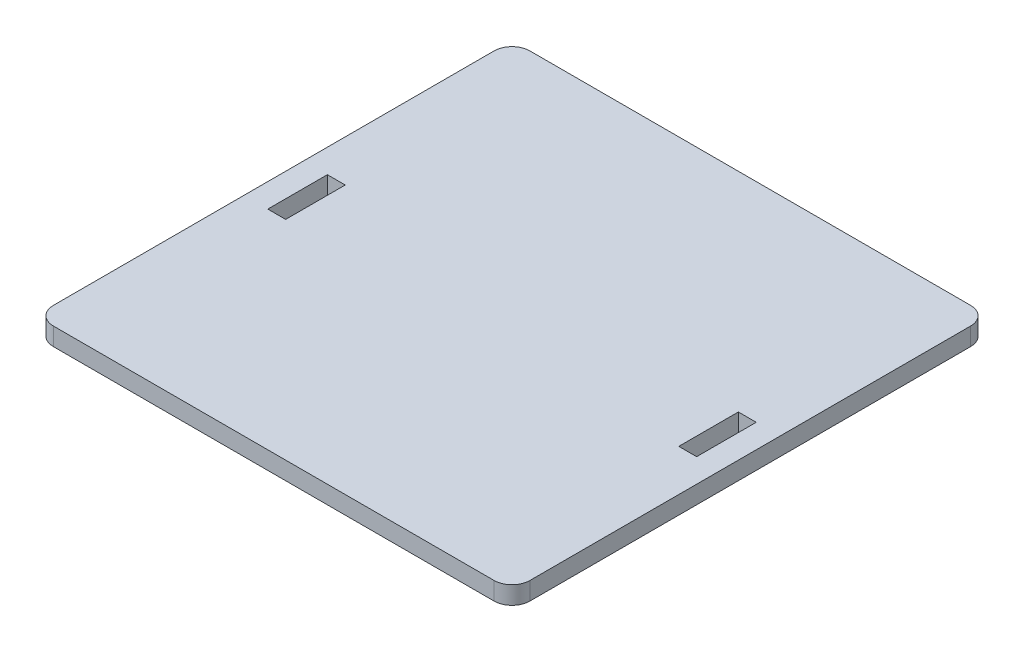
ISO-10303-21;
HEADER;
FILE_DESCRIPTION(('STEP AP214'),'2;1');
FILE_NAME('part.step','',(''),(''),'','','');
FILE_SCHEMA(('AUTOMOTIVE_DESIGN { 1 0 10303 214 1 1 1 1 }'));
ENDSEC;
DATA;
#1=APPLICATION_CONTEXT('core data for automotive mechanical design processes');
#2=APPLICATION_PROTOCOL_DEFINITION('international standard','automotive_design',2000,#1);
#3=PRODUCT_CONTEXT('',#1,'mechanical');
#4=PRODUCT('Part','Part','',(#3));
#5=PRODUCT_RELATED_PRODUCT_CATEGORY('part','',(#4));
#6=PRODUCT_DEFINITION_FORMATION('','',#4);
#7=PRODUCT_DEFINITION_CONTEXT('part definition',#1,'design');
#8=PRODUCT_DEFINITION('design','',#6,#7);
#9=PRODUCT_DEFINITION_SHAPE('','',#8);
#10=(LENGTH_UNIT() NAMED_UNIT(*) SI_UNIT(.MILLI.,.METRE.));
#11=(NAMED_UNIT(*) PLANE_ANGLE_UNIT() SI_UNIT($,.RADIAN.));
#12=(NAMED_UNIT(*) SI_UNIT($,.STERADIAN.) SOLID_ANGLE_UNIT());
#13=UNCERTAINTY_MEASURE_WITH_UNIT(LENGTH_MEASURE(1.E-05),#10,'distance_accuracy_value','');
#14=(GEOMETRIC_REPRESENTATION_CONTEXT(3) GLOBAL_UNCERTAINTY_ASSIGNED_CONTEXT((#13)) GLOBAL_UNIT_ASSIGNED_CONTEXT((#10,
#11,#12)) REPRESENTATION_CONTEXT('',''));
#15=CARTESIAN_POINT('',(0.,0.,0.));
#16=DIRECTION('',(0.,0.,1.));
#17=DIRECTION('',(1.,0.,0.));
#18=AXIS2_PLACEMENT_3D('',#15,#16,#17);
#19=CARTESIAN_POINT('',(74.,6.,-154.));
#20=DIRECTION('',(0.,-1.,0.));
#21=DIRECTION('',(0.,0.,-1.));
#22=AXIS2_PLACEMENT_3D('',#19,#20,#21);
#23=PLANE('',#22);
#24=DIRECTION('',(0.,0.,1.));
#25=VECTOR('',#24,1.);
#26=CARTESIAN_POINT('',(-72.,6.,-90.));
#27=LINE('',#26,#25);
#28=CARTESIAN_POINT('',(-72.,6.,-90.));
#29=VERTEX_POINT('',#28);
#30=CARTESIAN_POINT('',(-72.,6.,-70.));
#31=VERTEX_POINT('',#30);
#32=EDGE_CURVE('E188',#29,#31,#27,.T.);
#33=ORIENTED_EDGE('',*,*,#32,.F.);
#34=DIRECTION('',(-1.,0.,0.));
#35=VECTOR('',#34,1.);
#36=CARTESIAN_POINT('',(-72.,6.,-90.));
#37=LINE('',#36,#35);
#38=CARTESIAN_POINT('',(-66.,6.,-90.));
#39=VERTEX_POINT('',#38);
#40=EDGE_CURVE('E196',#39,#29,#37,.T.);
#41=ORIENTED_EDGE('',*,*,#40,.F.);
#42=DIRECTION('',(0.,0.,-1.));
#43=VECTOR('',#42,1.);
#44=CARTESIAN_POINT('',(-66.,6.,-90.));
#45=LINE('',#44,#43);
#46=CARTESIAN_POINT('',(-66.,6.,-70.));
#47=VERTEX_POINT('',#46);
#48=EDGE_CURVE('E193',#47,#39,#45,.T.);
#49=ORIENTED_EDGE('',*,*,#48,.F.);
#50=DIRECTION('',(1.,0.,0.));
#51=VECTOR('',#50,1.);
#52=CARTESIAN_POINT('',(-72.,6.,-70.));
#53=LINE('',#52,#51);
#54=EDGE_CURVE('E190',#31,#47,#53,.T.);
#55=ORIENTED_EDGE('',*,*,#54,.F.);
#56=EDGE_LOOP('',(#33,#41,#49,#55));
#57=FACE_BOUND('',#56,.T.);
#58=CARTESIAN_POINT('',(74.,6.,-154.));
#59=DIRECTION('',(0.,1.,0.));
#60=DIRECTION('',(0.,0.,-1.));
#61=AXIS2_PLACEMENT_3D('',#58,#59,#60);
#62=CIRCLE('',#61,5.99999999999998);
#63=CARTESIAN_POINT('',(80.,6.,-154.));
#64=VERTEX_POINT('',#63);
#65=CARTESIAN_POINT('',(74.,6.,-160.));
#66=VERTEX_POINT('',#65);
#67=EDGE_CURVE('E219',#64,#66,#62,.T.);
#68=ORIENTED_EDGE('',*,*,#67,.T.);
#69=DIRECTION('',(-1.,0.,0.));
#70=VECTOR('',#69,1.);
#71=CARTESIAN_POINT('',(-74.,6.,-160.));
#72=LINE('',#71,#70);
#73=CARTESIAN_POINT('',(-74.,6.,-160.));
#74=VERTEX_POINT('',#73);
#75=EDGE_CURVE('E222',#66,#74,#72,.T.);
#76=ORIENTED_EDGE('',*,*,#75,.T.);
#77=CARTESIAN_POINT('',(-74.,6.,-154.));
#78=DIRECTION('',(0.,1.,0.));
#79=DIRECTION('',(0.,0.,-1.));
#80=AXIS2_PLACEMENT_3D('',#77,#78,#79);
#81=CIRCLE('',#80,5.99999999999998);
#82=CARTESIAN_POINT('',(-80.,6.,-154.));
#83=VERTEX_POINT('',#82);
#84=EDGE_CURVE('E225',#74,#83,#81,.T.);
#85=ORIENTED_EDGE('',*,*,#84,.T.);
#86=DIRECTION('',(0.,0.,1.));
#87=VECTOR('',#86,1.);
#88=CARTESIAN_POINT('',(-80.,6.,-6.00000000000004));
#89=LINE('',#88,#87);
#90=CARTESIAN_POINT('',(-80.,6.,-6.00000000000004));
#91=VERTEX_POINT('',#90);
#92=EDGE_CURVE('E227',#83,#91,#89,.T.);
#93=ORIENTED_EDGE('',*,*,#92,.T.);
#94=CARTESIAN_POINT('',(-74.,6.,-6.));
#95=DIRECTION('',(0.,1.,0.));
#96=DIRECTION('',(0.,0.,-1.));
#97=AXIS2_PLACEMENT_3D('',#94,#95,#96);
#98=CIRCLE('',#97,6.);
#99=CARTESIAN_POINT('',(-74.,6.,0.));
#100=VERTEX_POINT('',#99);
#101=EDGE_CURVE('E229',#91,#100,#98,.T.);
#102=ORIENTED_EDGE('',*,*,#101,.T.);
#103=DIRECTION('',(1.,0.,0.));
#104=VECTOR('',#103,1.);
#105=CARTESIAN_POINT('',(-74.,6.,0.));
#106=LINE('',#105,#104);
#107=CARTESIAN_POINT('',(74.,6.,0.));
#108=VERTEX_POINT('',#107);
#109=EDGE_CURVE('E231',#100,#108,#106,.T.);
#110=ORIENTED_EDGE('',*,*,#109,.T.);
#111=CARTESIAN_POINT('',(74.,6.,-6.00000000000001));
#112=DIRECTION('',(0.,1.,0.));
#113=DIRECTION('',(0.,0.,1.));
#114=AXIS2_PLACEMENT_3D('',#111,#112,#113);
#115=CIRCLE('',#114,6.);
#116=CARTESIAN_POINT('',(80.,6.,-6.00000000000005));
#117=VERTEX_POINT('',#116);
#118=EDGE_CURVE('E233',#108,#117,#115,.T.);
#119=ORIENTED_EDGE('',*,*,#118,.T.);
#120=DIRECTION('',(0.,0.,-1.));
#121=VECTOR('',#120,1.);
#122=CARTESIAN_POINT('',(80.,6.,-6.00000000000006));
#123=LINE('',#122,#121);
#124=EDGE_CURVE('E235',#117,#64,#123,.T.);
#125=ORIENTED_EDGE('',*,*,#124,.T.);
#126=EDGE_LOOP('',(#68,#76,#85,#93,#102,#110,#119,#125));
#127=FACE_BOUND('',#126,.T.);
#128=DIRECTION('',(0.,0.,-1.));
#129=VECTOR('',#128,1.);
#130=CARTESIAN_POINT('',(72.,6.,-90.));
#131=LINE('',#130,#129);
#132=CARTESIAN_POINT('',(72.,6.,-70.));
#133=VERTEX_POINT('',#132);
#134=CARTESIAN_POINT('',(72.,6.,-90.));
#135=VERTEX_POINT('',#134);
#136=EDGE_CURVE('E152',#133,#135,#131,.T.);
#137=ORIENTED_EDGE('',*,*,#136,.F.);
#138=DIRECTION('',(1.,0.,0.));
#139=VECTOR('',#138,1.);
#140=CARTESIAN_POINT('',(72.,6.,-70.));
#141=LINE('',#140,#139);
#142=CARTESIAN_POINT('',(66.,6.,-70.));
#143=VERTEX_POINT('',#142);
#144=EDGE_CURVE('E174',#143,#133,#141,.T.);
#145=ORIENTED_EDGE('',*,*,#144,.F.);
#146=DIRECTION('',(0.,0.,1.));
#147=VECTOR('',#146,1.);
#148=CARTESIAN_POINT('',(66.,6.,-90.));
#149=LINE('',#148,#147);
#150=CARTESIAN_POINT('',(66.,6.,-90.));
#151=VERTEX_POINT('',#150);
#152=EDGE_CURVE('E172',#151,#143,#149,.T.);
#153=ORIENTED_EDGE('',*,*,#152,.F.);
#154=DIRECTION('',(-1.,0.,0.));
#155=VECTOR('',#154,1.);
#156=CARTESIAN_POINT('',(72.,6.,-90.));
#157=LINE('',#156,#155);
#158=EDGE_CURVE('E160',#135,#151,#157,.T.);
#159=ORIENTED_EDGE('',*,*,#158,.F.);
#160=EDGE_LOOP('',(#137,#145,#153,#159));
#161=FACE_BOUND('',#160,.T.);
#162=ADVANCED_FACE('F39',(#57,#127,#161),#23,.F.);
#163=CARTESIAN_POINT('',(74.,0.,-154.));
#164=DIRECTION('',(0.,-1.,0.));
#165=DIRECTION('',(0.,0.,-1.));
#166=AXIS2_PLACEMENT_3D('',#163,#164,#165);
#167=PLANE('',#166);
#168=CARTESIAN_POINT('',(74.,0.,-154.));
#169=DIRECTION('',(0.,1.,0.));
#170=DIRECTION('',(0.,0.,-1.));
#171=AXIS2_PLACEMENT_3D('',#168,#169,#170);
#172=CIRCLE('',#171,5.99999999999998);
#173=CARTESIAN_POINT('',(80.,0.,-154.));
#174=VERTEX_POINT('',#173);
#175=CARTESIAN_POINT('',(74.,0.,-160.));
#176=VERTEX_POINT('',#175);
#177=EDGE_CURVE('E218',#174,#176,#172,.T.);
#178=ORIENTED_EDGE('',*,*,#177,.F.);
#179=DIRECTION('',(0.,0.,-1.));
#180=VECTOR('',#179,1.);
#181=CARTESIAN_POINT('',(80.,0.,-6.00000000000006));
#182=LINE('',#181,#180);
#183=CARTESIAN_POINT('',(80.,0.,-6.00000000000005));
#184=VERTEX_POINT('',#183);
#185=EDGE_CURVE('E223',#184,#174,#182,.T.);
#186=ORIENTED_EDGE('',*,*,#185,.F.);
#187=CARTESIAN_POINT('',(74.,0.,-6.00000000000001));
#188=DIRECTION('',(0.,1.,0.));
#189=DIRECTION('',(0.,0.,1.));
#190=AXIS2_PLACEMENT_3D('',#187,#188,#189);
#191=CIRCLE('',#190,6.);
#192=CARTESIAN_POINT('',(74.,0.,0.));
#193=VERTEX_POINT('',#192);
#194=EDGE_CURVE('E250',#193,#184,#191,.T.);
#195=ORIENTED_EDGE('',*,*,#194,.F.);
#196=DIRECTION('',(1.,0.,0.));
#197=VECTOR('',#196,1.);
#198=CARTESIAN_POINT('',(-74.,0.,0.));
#199=LINE('',#198,#197);
#200=CARTESIAN_POINT('',(-74.,0.,0.));
#201=VERTEX_POINT('',#200);
#202=EDGE_CURVE('E248',#201,#193,#199,.T.);
#203=ORIENTED_EDGE('',*,*,#202,.F.);
#204=CARTESIAN_POINT('',(-74.,0.,-6.));
#205=DIRECTION('',(0.,1.,0.));
#206=DIRECTION('',(0.,0.,-1.));
#207=AXIS2_PLACEMENT_3D('',#204,#205,#206);
#208=CIRCLE('',#207,6.);
#209=CARTESIAN_POINT('',(-80.,0.,-6.00000000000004));
#210=VERTEX_POINT('',#209);
#211=EDGE_CURVE('E246',#210,#201,#208,.T.);
#212=ORIENTED_EDGE('',*,*,#211,.F.);
#213=DIRECTION('',(0.,0.,1.));
#214=VECTOR('',#213,1.);
#215=CARTESIAN_POINT('',(-80.,0.,-6.00000000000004));
#216=LINE('',#215,#214);
#217=CARTESIAN_POINT('',(-80.,0.,-154.));
#218=VERTEX_POINT('',#217);
#219=EDGE_CURVE('E244',#218,#210,#216,.T.);
#220=ORIENTED_EDGE('',*,*,#219,.F.);
#221=CARTESIAN_POINT('',(-74.,0.,-154.));
#222=DIRECTION('',(0.,1.,0.));
#223=DIRECTION('',(0.,0.,-1.));
#224=AXIS2_PLACEMENT_3D('',#221,#222,#223);
#225=CIRCLE('',#224,5.99999999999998);
#226=CARTESIAN_POINT('',(-74.,0.,-160.));
#227=VERTEX_POINT('',#226);
#228=EDGE_CURVE('E242',#227,#218,#225,.T.);
#229=ORIENTED_EDGE('',*,*,#228,.F.);
#230=DIRECTION('',(-1.,0.,0.));
#231=VECTOR('',#230,1.);
#232=CARTESIAN_POINT('',(-74.,0.,-160.));
#233=LINE('',#232,#231);
#234=EDGE_CURVE('E240',#176,#227,#233,.T.);
#235=ORIENTED_EDGE('',*,*,#234,.F.);
#236=EDGE_LOOP('',(#178,#186,#195,#203,#212,#220,#229,#235));
#237=FACE_BOUND('',#236,.T.);
#238=DIRECTION('',(-1.,0.,0.));
#239=VECTOR('',#238,1.);
#240=CARTESIAN_POINT('',(-72.,0.,-90.));
#241=LINE('',#240,#239);
#242=CARTESIAN_POINT('',(-66.,0.,-90.));
#243=VERTEX_POINT('',#242);
#244=CARTESIAN_POINT('',(-72.,0.,-90.));
#245=VERTEX_POINT('',#244);
#246=EDGE_CURVE('E191',#243,#245,#241,.T.);
#247=ORIENTED_EDGE('',*,*,#246,.T.);
#248=DIRECTION('',(0.,0.,1.));
#249=VECTOR('',#248,1.);
#250=CARTESIAN_POINT('',(-72.,0.,-90.));
#251=LINE('',#250,#249);
#252=CARTESIAN_POINT('',(-72.,0.,-70.));
#253=VERTEX_POINT('',#252);
#254=EDGE_CURVE('E168',#245,#253,#251,.T.);
#255=ORIENTED_EDGE('',*,*,#254,.T.);
#256=DIRECTION('',(1.,0.,0.));
#257=VECTOR('',#256,1.);
#258=CARTESIAN_POINT('',(-72.,0.,-70.));
#259=LINE('',#258,#257);
#260=CARTESIAN_POINT('',(-66.,0.,-70.));
#261=VERTEX_POINT('',#260);
#262=EDGE_CURVE('E201',#253,#261,#259,.T.);
#263=ORIENTED_EDGE('',*,*,#262,.T.);
#264=DIRECTION('',(0.,0.,-1.));
#265=VECTOR('',#264,1.);
#266=CARTESIAN_POINT('',(-66.,0.,-90.));
#267=LINE('',#266,#265);
#268=EDGE_CURVE('E204',#261,#243,#267,.T.);
#269=ORIENTED_EDGE('',*,*,#268,.T.);
#270=EDGE_LOOP('',(#247,#255,#263,#269));
#271=FACE_BOUND('',#270,.T.);
#272=DIRECTION('',(1.,0.,0.));
#273=VECTOR('',#272,1.);
#274=CARTESIAN_POINT('',(72.,0.,-70.));
#275=LINE('',#274,#273);
#276=CARTESIAN_POINT('',(66.,0.,-70.));
#277=VERTEX_POINT('',#276);
#278=CARTESIAN_POINT('',(72.,0.,-70.));
#279=VERTEX_POINT('',#278);
#280=EDGE_CURVE('E161',#277,#279,#275,.T.);
#281=ORIENTED_EDGE('',*,*,#280,.T.);
#282=DIRECTION('',(0.,0.,-1.));
#283=VECTOR('',#282,1.);
#284=CARTESIAN_POINT('',(72.,0.,-90.));
#285=LINE('',#284,#283);
#286=CARTESIAN_POINT('',(72.,0.,-90.));
#287=VERTEX_POINT('',#286);
#288=EDGE_CURVE('E62',#279,#287,#285,.T.);
#289=ORIENTED_EDGE('',*,*,#288,.T.);
#290=DIRECTION('',(-1.,0.,0.));
#291=VECTOR('',#290,1.);
#292=CARTESIAN_POINT('',(72.,0.,-90.));
#293=LINE('',#292,#291);
#294=CARTESIAN_POINT('',(66.,0.,-90.));
#295=VERTEX_POINT('',#294);
#296=EDGE_CURVE('E167',#287,#295,#293,.T.);
#297=ORIENTED_EDGE('',*,*,#296,.T.);
#298=DIRECTION('',(0.,0.,1.));
#299=VECTOR('',#298,1.);
#300=CARTESIAN_POINT('',(66.,0.,-90.));
#301=LINE('',#300,#299);
#302=EDGE_CURVE('E180',#295,#277,#301,.T.);
#303=ORIENTED_EDGE('',*,*,#302,.T.);
#304=EDGE_LOOP('',(#281,#289,#297,#303));
#305=FACE_BOUND('',#304,.T.);
#306=ADVANCED_FACE('F280',(#237,#271,#305),#167,.T.);
#307=CARTESIAN_POINT('',(74.,6.,-154.));
#308=DIRECTION('',(0.,-1.,0.));
#309=DIRECTION('',(0.,0.,-1.));
#310=AXIS2_PLACEMENT_3D('',#307,#308,#309);
#311=CYLINDRICAL_SURFACE('',#310,5.99999999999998);
#312=ORIENTED_EDGE('',*,*,#177,.T.);
#313=DIRECTION('',(0.,-1.,0.));
#314=VECTOR('',#313,1.);
#315=CARTESIAN_POINT('',(74.,6.,-160.));
#316=LINE('',#315,#314);
#317=EDGE_CURVE('E11',#66,#176,#316,.T.);
#318=ORIENTED_EDGE('',*,*,#317,.F.);
#319=ORIENTED_EDGE('',*,*,#67,.F.);
#320=DIRECTION('',(0.,-1.,0.));
#321=VECTOR('',#320,1.);
#322=CARTESIAN_POINT('',(80.,6.,-154.));
#323=LINE('',#322,#321);
#324=EDGE_CURVE('E237',#64,#174,#323,.T.);
#325=ORIENTED_EDGE('',*,*,#324,.T.);
#326=EDGE_LOOP('',(#312,#318,#319,#325));
#327=FACE_BOUND('',#326,.T.);
#328=ADVANCED_FACE('F41',(#327),#311,.T.);
#329=CARTESIAN_POINT('',(-74.,6.,-160.));
#330=DIRECTION('',(0.,0.,1.));
#331=DIRECTION('',(1.,0.,0.));
#332=AXIS2_PLACEMENT_3D('',#329,#330,#331);
#333=PLANE('',#332);
#334=ORIENTED_EDGE('',*,*,#234,.T.);
#335=DIRECTION('',(0.,-1.,0.));
#336=VECTOR('',#335,1.);
#337=CARTESIAN_POINT('',(-74.,6.,-160.));
#338=LINE('',#337,#336);
#339=EDGE_CURVE('E47',#74,#227,#338,.T.);
#340=ORIENTED_EDGE('',*,*,#339,.F.);
#341=ORIENTED_EDGE('',*,*,#75,.F.);
#342=ORIENTED_EDGE('',*,*,#317,.T.);
#343=EDGE_LOOP('',(#334,#340,#341,#342));
#344=FACE_BOUND('',#343,.T.);
#345=ADVANCED_FACE('F297',(#344),#333,.F.);
#346=CARTESIAN_POINT('',(-74.,6.,-154.));
#347=DIRECTION('',(0.,-1.,0.));
#348=DIRECTION('',(0.,0.,-1.));
#349=AXIS2_PLACEMENT_3D('',#346,#347,#348);
#350=CYLINDRICAL_SURFACE('',#349,5.99999999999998);
#351=ORIENTED_EDGE('',*,*,#228,.T.);
#352=DIRECTION('',(0.,-1.,0.));
#353=VECTOR('',#352,1.);
#354=CARTESIAN_POINT('',(-80.,6.,-154.));
#355=LINE('',#354,#353);
#356=EDGE_CURVE('E267',#83,#218,#355,.T.);
#357=ORIENTED_EDGE('',*,*,#356,.F.);
#358=ORIENTED_EDGE('',*,*,#84,.F.);
#359=ORIENTED_EDGE('',*,*,#339,.T.);
#360=EDGE_LOOP('',(#351,#357,#358,#359));
#361=FACE_BOUND('',#360,.T.);
#362=ADVANCED_FACE('F274',(#361),#350,.T.);
#363=CARTESIAN_POINT('',(-80.,6.,-6.00000000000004));
#364=DIRECTION('',(1.,0.,0.));
#365=DIRECTION('',(0.,0.,-1.));
#366=AXIS2_PLACEMENT_3D('',#363,#364,#365);
#367=PLANE('',#366);
#368=ORIENTED_EDGE('',*,*,#219,.T.);
#369=DIRECTION('',(0.,-1.,0.));
#370=VECTOR('',#369,1.);
#371=CARTESIAN_POINT('',(-80.,6.,-6.00000000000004));
#372=LINE('',#371,#370);
#373=EDGE_CURVE('E264',#91,#210,#372,.T.);
#374=ORIENTED_EDGE('',*,*,#373,.F.);
#375=ORIENTED_EDGE('',*,*,#92,.F.);
#376=ORIENTED_EDGE('',*,*,#356,.T.);
#377=EDGE_LOOP('',(#368,#374,#375,#376));
#378=FACE_BOUND('',#377,.T.);
#379=ADVANCED_FACE('F286',(#378),#367,.F.);
#380=CARTESIAN_POINT('',(-74.,6.,-6.));
#381=DIRECTION('',(0.,-1.,0.));
#382=DIRECTION('',(0.,0.,-1.));
#383=AXIS2_PLACEMENT_3D('',#380,#381,#382);
#384=CYLINDRICAL_SURFACE('',#383,6.);
#385=ORIENTED_EDGE('',*,*,#211,.T.);
#386=DIRECTION('',(0.,-1.,0.));
#387=VECTOR('',#386,1.);
#388=CARTESIAN_POINT('',(-74.,6.,0.));
#389=LINE('',#388,#387);
#390=EDGE_CURVE('E261',#100,#201,#389,.T.);
#391=ORIENTED_EDGE('',*,*,#390,.F.);
#392=ORIENTED_EDGE('',*,*,#101,.F.);
#393=ORIENTED_EDGE('',*,*,#373,.T.);
#394=EDGE_LOOP('',(#385,#391,#392,#393));
#395=FACE_BOUND('',#394,.T.);
#396=ADVANCED_FACE('F290',(#395),#384,.T.);
#397=CARTESIAN_POINT('',(-74.,6.,0.));
#398=DIRECTION('',(0.,0.,-1.));
#399=DIRECTION('',(-1.,0.,0.));
#400=AXIS2_PLACEMENT_3D('',#397,#398,#399);
#401=PLANE('',#400);
#402=ORIENTED_EDGE('',*,*,#202,.T.);
#403=DIRECTION('',(0.,-1.,0.));
#404=VECTOR('',#403,1.);
#405=CARTESIAN_POINT('',(74.,6.,0.));
#406=LINE('',#405,#404);
#407=EDGE_CURVE('E258',#108,#193,#406,.T.);
#408=ORIENTED_EDGE('',*,*,#407,.F.);
#409=ORIENTED_EDGE('',*,*,#109,.F.);
#410=ORIENTED_EDGE('',*,*,#390,.T.);
#411=EDGE_LOOP('',(#402,#408,#409,#410));
#412=FACE_BOUND('',#411,.T.);
#413=ADVANCED_FACE('F310',(#412),#401,.F.);
#414=CARTESIAN_POINT('',(74.,6.,-6.00000000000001));
#415=DIRECTION('',(0.,-1.,0.));
#416=DIRECTION('',(0.,0.,-1.));
#417=AXIS2_PLACEMENT_3D('',#414,#415,#416);
#418=CYLINDRICAL_SURFACE('',#417,6.);
#419=ORIENTED_EDGE('',*,*,#194,.T.);
#420=DIRECTION('',(0.,-1.,0.));
#421=VECTOR('',#420,1.);
#422=CARTESIAN_POINT('',(80.,6.,-6.00000000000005));
#423=LINE('',#422,#421);
#424=EDGE_CURVE('E255',#117,#184,#423,.T.);
#425=ORIENTED_EDGE('',*,*,#424,.F.);
#426=ORIENTED_EDGE('',*,*,#118,.F.);
#427=ORIENTED_EDGE('',*,*,#407,.T.);
#428=EDGE_LOOP('',(#419,#425,#426,#427));
#429=FACE_BOUND('',#428,.T.);
#430=ADVANCED_FACE('F308',(#429),#418,.T.);
#431=CARTESIAN_POINT('',(80.,6.,-6.00000000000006));
#432=DIRECTION('',(-1.,0.,0.));
#433=DIRECTION('',(0.,0.,1.));
#434=AXIS2_PLACEMENT_3D('',#431,#432,#433);
#435=PLANE('',#434);
#436=ORIENTED_EDGE('',*,*,#185,.T.);
#437=ORIENTED_EDGE('',*,*,#324,.F.);
#438=ORIENTED_EDGE('',*,*,#124,.F.);
#439=ORIENTED_EDGE('',*,*,#424,.T.);
#440=EDGE_LOOP('',(#436,#437,#438,#439));
#441=FACE_BOUND('',#440,.T.);
#442=ADVANCED_FACE('F303',(#441),#435,.F.);
#443=CARTESIAN_POINT('',(-72.,6.,-90.));
#444=DIRECTION('',(1.,0.,0.));
#445=DIRECTION('',(0.,0.,-1.));
#446=AXIS2_PLACEMENT_3D('',#443,#444,#445);
#447=PLANE('',#446);
#448=ORIENTED_EDGE('',*,*,#254,.F.);
#449=DIRECTION('',(0.,-1.,0.));
#450=VECTOR('',#449,1.);
#451=CARTESIAN_POINT('',(-72.,6.,-90.));
#452=LINE('',#451,#450);
#453=EDGE_CURVE('E198',#29,#245,#452,.T.);
#454=ORIENTED_EDGE('',*,*,#453,.F.);
#455=ORIENTED_EDGE('',*,*,#32,.T.);
#456=DIRECTION('',(0.,-1.,0.));
#457=VECTOR('',#456,1.);
#458=CARTESIAN_POINT('',(-72.,6.,-70.));
#459=LINE('',#458,#457);
#460=EDGE_CURVE('E215',#31,#253,#459,.T.);
#461=ORIENTED_EDGE('',*,*,#460,.T.);
#462=EDGE_LOOP('',(#448,#454,#455,#461));
#463=FACE_BOUND('',#462,.T.);
#464=ADVANCED_FACE('F328',(#463),#447,.T.);
#465=CARTESIAN_POINT('',(-72.,6.,-70.));
#466=DIRECTION('',(0.,0.,-1.));
#467=DIRECTION('',(-1.,0.,0.));
#468=AXIS2_PLACEMENT_3D('',#465,#466,#467);
#469=PLANE('',#468);
#470=ORIENTED_EDGE('',*,*,#262,.F.);
#471=ORIENTED_EDGE('',*,*,#460,.F.);
#472=ORIENTED_EDGE('',*,*,#54,.T.);
#473=DIRECTION('',(0.,-1.,0.));
#474=VECTOR('',#473,1.);
#475=CARTESIAN_POINT('',(-66.,6.,-70.));
#476=LINE('',#475,#474);
#477=EDGE_CURVE('E213',#47,#261,#476,.T.);
#478=ORIENTED_EDGE('',*,*,#477,.T.);
#479=EDGE_LOOP('',(#470,#471,#472,#478));
#480=FACE_BOUND('',#479,.T.);
#481=ADVANCED_FACE('F335',(#480),#469,.T.);
#482=CARTESIAN_POINT('',(-66.,6.,-90.));
#483=DIRECTION('',(-1.,0.,0.));
#484=DIRECTION('',(0.,0.,1.));
#485=AXIS2_PLACEMENT_3D('',#482,#483,#484);
#486=PLANE('',#485);
#487=ORIENTED_EDGE('',*,*,#268,.F.);
#488=ORIENTED_EDGE('',*,*,#477,.F.);
#489=ORIENTED_EDGE('',*,*,#48,.T.);
#490=DIRECTION('',(0.,-1.,0.));
#491=VECTOR('',#490,1.);
#492=CARTESIAN_POINT('',(-66.,6.,-90.));
#493=LINE('',#492,#491);
#494=EDGE_CURVE('E211',#39,#243,#493,.T.);
#495=ORIENTED_EDGE('',*,*,#494,.T.);
#496=EDGE_LOOP('',(#487,#488,#489,#495));
#497=FACE_BOUND('',#496,.T.);
#498=ADVANCED_FACE('F340',(#497),#486,.T.);
#499=CARTESIAN_POINT('',(-72.,6.,-90.));
#500=DIRECTION('',(0.,0.,1.));
#501=DIRECTION('',(1.,0.,0.));
#502=AXIS2_PLACEMENT_3D('',#499,#500,#501);
#503=PLANE('',#502);
#504=ORIENTED_EDGE('',*,*,#246,.F.);
#505=ORIENTED_EDGE('',*,*,#494,.F.);
#506=ORIENTED_EDGE('',*,*,#40,.T.);
#507=ORIENTED_EDGE('',*,*,#453,.T.);
#508=EDGE_LOOP('',(#504,#505,#506,#507));
#509=FACE_BOUND('',#508,.T.);
#510=ADVANCED_FACE('F346',(#509),#503,.T.);
#511=CARTESIAN_POINT('',(72.,6.,-90.));
#512=DIRECTION('',(-1.,0.,0.));
#513=DIRECTION('',(0.,0.,1.));
#514=AXIS2_PLACEMENT_3D('',#511,#512,#513);
#515=PLANE('',#514);
#516=ORIENTED_EDGE('',*,*,#288,.F.);
#517=DIRECTION('',(0.,-1.,0.));
#518=VECTOR('',#517,1.);
#519=CARTESIAN_POINT('',(72.,6.,-70.));
#520=LINE('',#519,#518);
#521=EDGE_CURVE('E156',#133,#279,#520,.T.);
#522=ORIENTED_EDGE('',*,*,#521,.F.);
#523=ORIENTED_EDGE('',*,*,#136,.T.);
#524=DIRECTION('',(0.,-1.,0.));
#525=VECTOR('',#524,1.);
#526=CARTESIAN_POINT('',(72.,6.,-90.));
#527=LINE('',#526,#525);
#528=EDGE_CURVE('E155',#135,#287,#527,.T.);
#529=ORIENTED_EDGE('',*,*,#528,.T.);
#530=EDGE_LOOP('',(#516,#522,#523,#529));
#531=FACE_BOUND('',#530,.T.);
#532=ADVANCED_FACE('F154',(#531),#515,.T.);
#533=CARTESIAN_POINT('',(72.,6.,-90.));
#534=DIRECTION('',(0.,0.,1.));
#535=DIRECTION('',(1.,0.,0.));
#536=AXIS2_PLACEMENT_3D('',#533,#534,#535);
#537=PLANE('',#536);
#538=ORIENTED_EDGE('',*,*,#296,.F.);
#539=ORIENTED_EDGE('',*,*,#528,.F.);
#540=ORIENTED_EDGE('',*,*,#158,.T.);
#541=DIRECTION('',(0.,-1.,0.));
#542=VECTOR('',#541,1.);
#543=CARTESIAN_POINT('',(66.,6.,-90.));
#544=LINE('',#543,#542);
#545=EDGE_CURVE('E169',#151,#295,#544,.T.);
#546=ORIENTED_EDGE('',*,*,#545,.T.);
#547=EDGE_LOOP('',(#538,#539,#540,#546));
#548=FACE_BOUND('',#547,.T.);
#549=ADVANCED_FACE('F164',(#548),#537,.T.);
#550=CARTESIAN_POINT('',(66.,6.,-90.));
#551=DIRECTION('',(1.,0.,0.));
#552=DIRECTION('',(0.,0.,-1.));
#553=AXIS2_PLACEMENT_3D('',#550,#551,#552);
#554=PLANE('',#553);
#555=ORIENTED_EDGE('',*,*,#302,.F.);
#556=ORIENTED_EDGE('',*,*,#545,.F.);
#557=ORIENTED_EDGE('',*,*,#152,.T.);
#558=DIRECTION('',(0.,-1.,0.));
#559=VECTOR('',#558,1.);
#560=CARTESIAN_POINT('',(66.,6.,-70.));
#561=LINE('',#560,#559);
#562=EDGE_CURVE('E54',#143,#277,#561,.T.);
#563=ORIENTED_EDGE('',*,*,#562,.T.);
#564=EDGE_LOOP('',(#555,#556,#557,#563));
#565=FACE_BOUND('',#564,.T.);
#566=ADVANCED_FACE('F365',(#565),#554,.T.);
#567=CARTESIAN_POINT('',(72.,6.,-70.));
#568=DIRECTION('',(0.,0.,-1.));
#569=DIRECTION('',(-1.,0.,0.));
#570=AXIS2_PLACEMENT_3D('',#567,#568,#569);
#571=PLANE('',#570);
#572=ORIENTED_EDGE('',*,*,#280,.F.);
#573=ORIENTED_EDGE('',*,*,#562,.F.);
#574=ORIENTED_EDGE('',*,*,#144,.T.);
#575=ORIENTED_EDGE('',*,*,#521,.T.);
#576=EDGE_LOOP('',(#572,#573,#574,#575));
#577=FACE_BOUND('',#576,.T.);
#578=ADVANCED_FACE('F368',(#577),#571,.T.);
#579=CLOSED_SHELL('',(#162,#306,#328,#345,#362,#379,#396,#413,#430,#442,#464,#481,#498,#510,
#532,#549,#566,#578));
#580=MANIFOLD_SOLID_BREP('B2',#579);
#581=ADVANCED_BREP_SHAPE_REPRESENTATION('',(#18,#580),#14);
#582=SHAPE_DEFINITION_REPRESENTATION(#9,#581);
ENDSEC;
END-ISO-10303-21;
